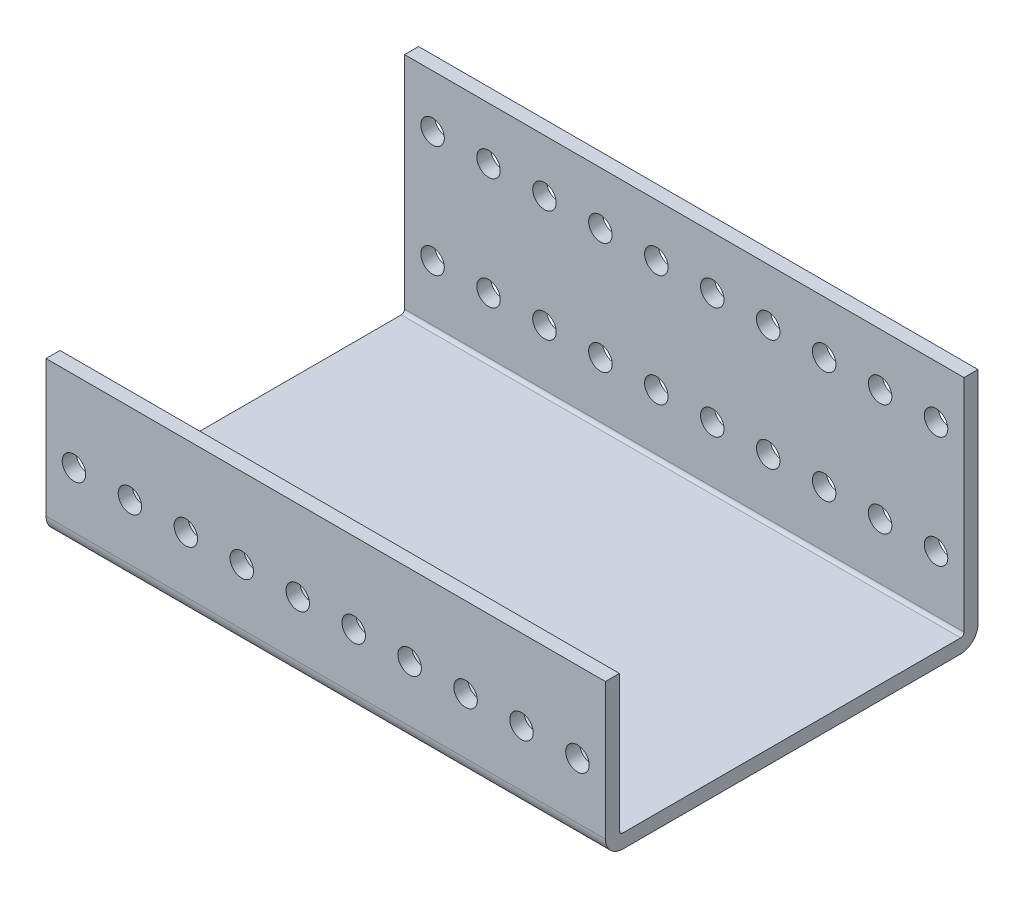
ISO-10303-21;
HEADER;
FILE_DESCRIPTION(('STEP AP214'),'2;1');
FILE_NAME('part.step','',(''),(''),'','','');
FILE_SCHEMA(('AUTOMOTIVE_DESIGN { 1 0 10303 214 1 1 1 1 }'));
ENDSEC;
DATA;
#1=APPLICATION_CONTEXT('core data for automotive mechanical design processes');
#2=APPLICATION_PROTOCOL_DEFINITION('international standard','automotive_design',2000,#1);
#3=PRODUCT_CONTEXT('',#1,'mechanical');
#4=PRODUCT('Part','Part','',(#3));
#5=PRODUCT_RELATED_PRODUCT_CATEGORY('part','',(#4));
#6=PRODUCT_DEFINITION_FORMATION('','',#4);
#7=PRODUCT_DEFINITION_CONTEXT('part definition',#1,'design');
#8=PRODUCT_DEFINITION('design','',#6,#7);
#9=PRODUCT_DEFINITION_SHAPE('','',#8);
#10=(LENGTH_UNIT() NAMED_UNIT(*) SI_UNIT(.MILLI.,.METRE.));
#11=(NAMED_UNIT(*) PLANE_ANGLE_UNIT() SI_UNIT($,.RADIAN.));
#12=(NAMED_UNIT(*) SI_UNIT($,.STERADIAN.) SOLID_ANGLE_UNIT());
#13=UNCERTAINTY_MEASURE_WITH_UNIT(LENGTH_MEASURE(1.E-05),#10,'distance_accuracy_value','');
#14=(GEOMETRIC_REPRESENTATION_CONTEXT(3) GLOBAL_UNCERTAINTY_ASSIGNED_CONTEXT((#13)) GLOBAL_UNIT_ASSIGNED_CONTEXT((#10,
#11,#12)) REPRESENTATION_CONTEXT('',''));
#15=CARTESIAN_POINT('',(0.,0.,0.));
#16=DIRECTION('',(0.,0.,1.));
#17=DIRECTION('',(1.,0.,0.));
#18=AXIS2_PLACEMENT_3D('',#15,#16,#17);
#19=CARTESIAN_POINT('',(361.95,42.037,-76.327));
#20=DIRECTION('',(0.,0.,-1.));
#21=DIRECTION('',(0.,1.,0.));
#22=AXIS2_PLACEMENT_3D('',#19,#20,#21);
#23=CYLINDRICAL_SURFACE('',#22,2.667);
#24=CARTESIAN_POINT('',(361.95,42.037,-78.232));
#25=DIRECTION('',(0.,0.,1.));
#26=DIRECTION('',(0.,-1.,0.));
#27=AXIS2_PLACEMENT_3D('',#24,#25,#26);
#28=CIRCLE('',#27,2.667);
#29=CARTESIAN_POINT('',(361.95,39.37,-78.232));
#30=VERTEX_POINT('',#29);
#31=EDGE_CURVE('E521',#30,#30,#28,.T.);
#32=ORIENTED_EDGE('',*,*,#31,.T.);
#33=EDGE_LOOP('',(#32));
#34=FACE_BOUND('',#33,.T.);
#35=CARTESIAN_POINT('',(361.95,42.037,-81.407));
#36=DIRECTION('',(0.,0.,-1.));
#37=DIRECTION('',(0.,1.,0.));
#38=AXIS2_PLACEMENT_3D('',#35,#36,#37);
#39=CIRCLE('',#38,2.667);
#40=CARTESIAN_POINT('',(361.95,44.704,-81.407));
#41=VERTEX_POINT('',#40);
#42=EDGE_CURVE('E421',#41,#41,#39,.T.);
#43=ORIENTED_EDGE('',*,*,#42,.T.);
#44=EDGE_LOOP('',(#43));
#45=FACE_BOUND('',#44,.T.);
#46=ADVANCED_FACE('F17',(#34,#45),#23,.F.);
#47=CARTESIAN_POINT('',(374.65,42.037,-76.327));
#48=DIRECTION('',(0.,0.,-1.));
#49=DIRECTION('',(0.,1.,0.));
#50=AXIS2_PLACEMENT_3D('',#47,#48,#49);
#51=CYLINDRICAL_SURFACE('',#50,2.667);
#52=CARTESIAN_POINT('',(374.65,42.037,-78.232));
#53=DIRECTION('',(0.,0.,1.));
#54=DIRECTION('',(0.,-1.,0.));
#55=AXIS2_PLACEMENT_3D('',#52,#53,#54);
#56=CIRCLE('',#55,2.667);
#57=CARTESIAN_POINT('',(374.65,39.37,-78.232));
#58=VERTEX_POINT('',#57);
#59=EDGE_CURVE('E524',#58,#58,#56,.T.);
#60=ORIENTED_EDGE('',*,*,#59,.T.);
#61=EDGE_LOOP('',(#60));
#62=FACE_BOUND('',#61,.T.);
#63=CARTESIAN_POINT('',(374.65,42.037,-81.407));
#64=DIRECTION('',(0.,0.,-1.));
#65=DIRECTION('',(0.,1.,0.));
#66=AXIS2_PLACEMENT_3D('',#63,#64,#65);
#67=CIRCLE('',#66,2.667);
#68=CARTESIAN_POINT('',(374.65,44.704,-81.407));
#69=VERTEX_POINT('',#68);
#70=EDGE_CURVE('E418',#69,#69,#67,.T.);
#71=ORIENTED_EDGE('',*,*,#70,.T.);
#72=EDGE_LOOP('',(#71));
#73=FACE_BOUND('',#72,.T.);
#74=ADVANCED_FACE('F740',(#62,#73),#51,.F.);
#75=CARTESIAN_POINT('',(387.35,42.037,-76.327));
#76=DIRECTION('',(0.,0.,-1.));
#77=DIRECTION('',(0.,1.,0.));
#78=AXIS2_PLACEMENT_3D('',#75,#76,#77);
#79=CYLINDRICAL_SURFACE('',#78,2.667);
#80=CARTESIAN_POINT('',(387.35,42.037,-78.232));
#81=DIRECTION('',(0.,0.,1.));
#82=DIRECTION('',(0.,-1.,0.));
#83=AXIS2_PLACEMENT_3D('',#80,#81,#82);
#84=CIRCLE('',#83,2.667);
#85=CARTESIAN_POINT('',(387.35,39.37,-78.232));
#86=VERTEX_POINT('',#85);
#87=EDGE_CURVE('E537',#86,#86,#84,.T.);
#88=ORIENTED_EDGE('',*,*,#87,.T.);
#89=EDGE_LOOP('',(#88));
#90=FACE_BOUND('',#89,.T.);
#91=CARTESIAN_POINT('',(387.35,42.037,-81.407));
#92=DIRECTION('',(0.,0.,-1.));
#93=DIRECTION('',(0.,1.,0.));
#94=AXIS2_PLACEMENT_3D('',#91,#92,#93);
#95=CIRCLE('',#94,2.667);
#96=CARTESIAN_POINT('',(387.35,44.704,-81.407));
#97=VERTEX_POINT('',#96);
#98=EDGE_CURVE('E417',#97,#97,#95,.T.);
#99=ORIENTED_EDGE('',*,*,#98,.T.);
#100=EDGE_LOOP('',(#99));
#101=FACE_BOUND('',#100,.T.);
#102=ADVANCED_FACE('F746',(#90,#101),#79,.F.);
#103=CARTESIAN_POINT('',(400.05,42.037,-76.327));
#104=DIRECTION('',(0.,0.,-1.));
#105=DIRECTION('',(0.,1.,0.));
#106=AXIS2_PLACEMENT_3D('',#103,#104,#105);
#107=CYLINDRICAL_SURFACE('',#106,2.667);
#108=CARTESIAN_POINT('',(400.05,42.037,-78.232));
#109=DIRECTION('',(0.,0.,1.));
#110=DIRECTION('',(0.,-1.,0.));
#111=AXIS2_PLACEMENT_3D('',#108,#109,#110);
#112=CIRCLE('',#111,2.667);
#113=CARTESIAN_POINT('',(400.05,39.37,-78.232));
#114=VERTEX_POINT('',#113);
#115=EDGE_CURVE('E531',#114,#114,#112,.T.);
#116=ORIENTED_EDGE('',*,*,#115,.T.);
#117=EDGE_LOOP('',(#116));
#118=FACE_BOUND('',#117,.T.);
#119=CARTESIAN_POINT('',(400.05,42.037,-81.407));
#120=DIRECTION('',(0.,0.,-1.));
#121=DIRECTION('',(0.,1.,0.));
#122=AXIS2_PLACEMENT_3D('',#119,#120,#121);
#123=CIRCLE('',#122,2.667);
#124=CARTESIAN_POINT('',(400.05,44.704,-81.407));
#125=VERTEX_POINT('',#124);
#126=EDGE_CURVE('E414',#125,#125,#123,.T.);
#127=ORIENTED_EDGE('',*,*,#126,.T.);
#128=EDGE_LOOP('',(#127));
#129=FACE_BOUND('',#128,.T.);
#130=ADVANCED_FACE('F883',(#118,#129),#107,.F.);
#131=CARTESIAN_POINT('',(412.75,42.037,-76.327));
#132=DIRECTION('',(0.,0.,-1.));
#133=DIRECTION('',(0.,1.,0.));
#134=AXIS2_PLACEMENT_3D('',#131,#132,#133);
#135=CYLINDRICAL_SURFACE('',#134,2.667);
#136=CARTESIAN_POINT('',(412.75,42.037,-78.232));
#137=DIRECTION('',(0.,0.,1.));
#138=DIRECTION('',(0.,-1.,0.));
#139=AXIS2_PLACEMENT_3D('',#136,#137,#138);
#140=CIRCLE('',#139,2.667);
#141=CARTESIAN_POINT('',(412.75,39.37,-78.232));
#142=VERTEX_POINT('',#141);
#143=EDGE_CURVE('E528',#142,#142,#140,.T.);
#144=ORIENTED_EDGE('',*,*,#143,.T.);
#145=EDGE_LOOP('',(#144));
#146=FACE_BOUND('',#145,.T.);
#147=CARTESIAN_POINT('',(412.75,42.037,-81.407));
#148=DIRECTION('',(0.,0.,-1.));
#149=DIRECTION('',(0.,1.,0.));
#150=AXIS2_PLACEMENT_3D('',#147,#148,#149);
#151=CIRCLE('',#150,2.667);
#152=CARTESIAN_POINT('',(412.75,44.704,-81.407));
#153=VERTEX_POINT('',#152);
#154=EDGE_CURVE('E407',#153,#153,#151,.T.);
#155=ORIENTED_EDGE('',*,*,#154,.T.);
#156=EDGE_LOOP('',(#155));
#157=FACE_BOUND('',#156,.T.);
#158=ADVANCED_FACE('F899',(#146,#157),#135,.F.);
#159=CARTESIAN_POINT('',(425.45,42.037,-76.327));
#160=DIRECTION('',(0.,0.,-1.));
#161=DIRECTION('',(0.,1.,0.));
#162=AXIS2_PLACEMENT_3D('',#159,#160,#161);
#163=CYLINDRICAL_SURFACE('',#162,2.667);
#164=CARTESIAN_POINT('',(425.45,42.037,-78.232));
#165=DIRECTION('',(0.,0.,1.));
#166=DIRECTION('',(0.,-1.,0.));
#167=AXIS2_PLACEMENT_3D('',#164,#165,#166);
#168=CIRCLE('',#167,2.667);
#169=CARTESIAN_POINT('',(425.45,39.37,-78.232));
#170=VERTEX_POINT('',#169);
#171=EDGE_CURVE('E527',#170,#170,#168,.T.);
#172=ORIENTED_EDGE('',*,*,#171,.T.);
#173=EDGE_LOOP('',(#172));
#174=FACE_BOUND('',#173,.T.);
#175=CARTESIAN_POINT('',(425.45,42.037,-81.407));
#176=DIRECTION('',(0.,0.,-1.));
#177=DIRECTION('',(0.,1.,0.));
#178=AXIS2_PLACEMENT_3D('',#175,#176,#177);
#179=CIRCLE('',#178,2.667);
#180=CARTESIAN_POINT('',(425.45,44.704,-81.407));
#181=VERTEX_POINT('',#180);
#182=EDGE_CURVE('E403',#181,#181,#179,.T.);
#183=ORIENTED_EDGE('',*,*,#182,.T.);
#184=EDGE_LOOP('',(#183));
#185=FACE_BOUND('',#184,.T.);
#186=ADVANCED_FACE('F895',(#174,#185),#163,.F.);
#187=CARTESIAN_POINT('',(438.15,42.037,-76.327));
#188=DIRECTION('',(0.,0.,-1.));
#189=DIRECTION('',(0.,1.,0.));
#190=AXIS2_PLACEMENT_3D('',#187,#188,#189);
#191=CYLINDRICAL_SURFACE('',#190,2.667);
#192=CARTESIAN_POINT('',(438.15,42.037,-78.232));
#193=DIRECTION('',(0.,0.,1.));
#194=DIRECTION('',(0.,-1.,0.));
#195=AXIS2_PLACEMENT_3D('',#192,#193,#194);
#196=CIRCLE('',#195,2.667);
#197=CARTESIAN_POINT('',(438.15,39.37,-78.232));
#198=VERTEX_POINT('',#197);
#199=EDGE_CURVE('E517',#198,#198,#196,.T.);
#200=ORIENTED_EDGE('',*,*,#199,.T.);
#201=EDGE_LOOP('',(#200));
#202=FACE_BOUND('',#201,.T.);
#203=CARTESIAN_POINT('',(438.15,42.037,-81.407));
#204=DIRECTION('',(0.,0.,-1.));
#205=DIRECTION('',(0.,1.,0.));
#206=AXIS2_PLACEMENT_3D('',#203,#204,#205);
#207=CIRCLE('',#206,2.667);
#208=CARTESIAN_POINT('',(438.15,44.704,-81.407));
#209=VERTEX_POINT('',#208);
#210=EDGE_CURVE('E400',#209,#209,#207,.T.);
#211=ORIENTED_EDGE('',*,*,#210,.T.);
#212=EDGE_LOOP('',(#211));
#213=FACE_BOUND('',#212,.T.);
#214=ADVANCED_FACE('F891',(#202,#213),#191,.F.);
#215=CARTESIAN_POINT('',(450.85,42.037,-76.327));
#216=DIRECTION('',(0.,0.,-1.));
#217=DIRECTION('',(0.,1.,0.));
#218=AXIS2_PLACEMENT_3D('',#215,#216,#217);
#219=CYLINDRICAL_SURFACE('',#218,2.667);
#220=CARTESIAN_POINT('',(450.85,42.037,-78.232));
#221=DIRECTION('',(0.,0.,1.));
#222=DIRECTION('',(0.,-1.,0.));
#223=AXIS2_PLACEMENT_3D('',#220,#221,#222);
#224=CIRCLE('',#223,2.667);
#225=CARTESIAN_POINT('',(450.85,39.37,-78.232));
#226=VERTEX_POINT('',#225);
#227=EDGE_CURVE('E514',#226,#226,#224,.T.);
#228=ORIENTED_EDGE('',*,*,#227,.T.);
#229=EDGE_LOOP('',(#228));
#230=FACE_BOUND('',#229,.T.);
#231=CARTESIAN_POINT('',(450.85,42.037,-81.407));
#232=DIRECTION('',(0.,0.,-1.));
#233=DIRECTION('',(0.,1.,0.));
#234=AXIS2_PLACEMENT_3D('',#231,#232,#233);
#235=CIRCLE('',#234,2.667);
#236=CARTESIAN_POINT('',(450.85,44.704,-81.407));
#237=VERTEX_POINT('',#236);
#238=EDGE_CURVE('E404',#237,#237,#235,.T.);
#239=ORIENTED_EDGE('',*,*,#238,.T.);
#240=EDGE_LOOP('',(#239));
#241=FACE_BOUND('',#240,.T.);
#242=ADVANCED_FACE('F887',(#230,#241),#219,.F.);
#243=CARTESIAN_POINT('',(463.55,42.037,-76.327));
#244=DIRECTION('',(0.,0.,-1.));
#245=DIRECTION('',(0.,1.,0.));
#246=AXIS2_PLACEMENT_3D('',#243,#244,#245);
#247=CYLINDRICAL_SURFACE('',#246,2.667);
#248=CARTESIAN_POINT('',(463.55,42.037,-78.232));
#249=DIRECTION('',(0.,0.,1.));
#250=DIRECTION('',(0.,-1.,0.));
#251=AXIS2_PLACEMENT_3D('',#248,#249,#250);
#252=CIRCLE('',#251,2.667);
#253=CARTESIAN_POINT('',(463.55,39.37,-78.232));
#254=VERTEX_POINT('',#253);
#255=EDGE_CURVE('E518',#254,#254,#252,.T.);
#256=ORIENTED_EDGE('',*,*,#255,.T.);
#257=EDGE_LOOP('',(#256));
#258=FACE_BOUND('',#257,.T.);
#259=CARTESIAN_POINT('',(463.55,42.037,-81.407));
#260=DIRECTION('',(0.,0.,-1.));
#261=DIRECTION('',(0.,1.,0.));
#262=AXIS2_PLACEMENT_3D('',#259,#260,#261);
#263=CIRCLE('',#262,2.667);
#264=CARTESIAN_POINT('',(463.55,44.704,-81.407));
#265=VERTEX_POINT('',#264);
#266=EDGE_CURVE('E398',#265,#265,#263,.T.);
#267=ORIENTED_EDGE('',*,*,#266,.T.);
#268=EDGE_LOOP('',(#267));
#269=FACE_BOUND('',#268,.T.);
#270=ADVANCED_FACE('F837',(#258,#269),#247,.F.);
#271=CARTESIAN_POINT('',(476.25,42.037,-76.327));
#272=DIRECTION('',(0.,0.,-1.));
#273=DIRECTION('',(0.,1.,0.));
#274=AXIS2_PLACEMENT_3D('',#271,#272,#273);
#275=CYLINDRICAL_SURFACE('',#274,2.667);
#276=CARTESIAN_POINT('',(476.25,42.037,-78.232));
#277=DIRECTION('',(0.,0.,1.));
#278=DIRECTION('',(0.,-1.,0.));
#279=AXIS2_PLACEMENT_3D('',#276,#277,#278);
#280=CIRCLE('',#279,2.667);
#281=CARTESIAN_POINT('',(476.25,39.37,-78.232));
#282=VERTEX_POINT('',#281);
#283=EDGE_CURVE('E513',#282,#282,#280,.T.);
#284=ORIENTED_EDGE('',*,*,#283,.T.);
#285=EDGE_LOOP('',(#284));
#286=FACE_BOUND('',#285,.T.);
#287=CARTESIAN_POINT('',(476.25,42.037,-81.407));
#288=DIRECTION('',(0.,0.,-1.));
#289=DIRECTION('',(0.,1.,0.));
#290=AXIS2_PLACEMENT_3D('',#287,#288,#289);
#291=CIRCLE('',#290,2.667);
#292=CARTESIAN_POINT('',(476.25,44.704,-81.407));
#293=VERTEX_POINT('',#292);
#294=EDGE_CURVE('E395',#293,#293,#291,.T.);
#295=ORIENTED_EDGE('',*,*,#294,.T.);
#296=EDGE_LOOP('',(#295));
#297=FACE_BOUND('',#296,.T.);
#298=ADVANCED_FACE('F833',(#286,#297),#275,.F.);
#299=CARTESIAN_POINT('',(361.95,16.637,-81.407));
#300=DIRECTION('',(0.,0.,1.));
#301=DIRECTION('',(1.,0.,0.));
#302=AXIS2_PLACEMENT_3D('',#299,#300,#301);
#303=CYLINDRICAL_SURFACE('',#302,2.667);
#304=CARTESIAN_POINT('',(361.95,16.637,0.));
#305=DIRECTION('',(0.,0.,-1.));
#306=DIRECTION('',(-1.,0.,0.));
#307=AXIS2_PLACEMENT_3D('',#304,#305,#306);
#308=CIRCLE('',#307,2.667);
#309=CARTESIAN_POINT('',(359.283,16.637,0.));
#310=VERTEX_POINT('',#309);
#311=EDGE_CURVE('E632',#310,#310,#308,.T.);
#312=ORIENTED_EDGE('',*,*,#311,.T.);
#313=EDGE_LOOP('',(#312));
#314=FACE_BOUND('',#313,.T.);
#315=CARTESIAN_POINT('',(361.95,16.637,3.175));
#316=DIRECTION('',(0.,0.,1.));
#317=DIRECTION('',(1.,0.,0.));
#318=AXIS2_PLACEMENT_3D('',#315,#316,#317);
#319=CIRCLE('',#318,2.667);
#320=CARTESIAN_POINT('',(364.617,16.637,3.175));
#321=VERTEX_POINT('',#320);
#322=EDGE_CURVE('E684',#321,#321,#319,.T.);
#323=ORIENTED_EDGE('',*,*,#322,.T.);
#324=EDGE_LOOP('',(#323));
#325=FACE_BOUND('',#324,.T.);
#326=ADVANCED_FACE('F836',(#314,#325),#303,.F.);
#327=CARTESIAN_POINT('',(374.65,16.637,-81.407));
#328=DIRECTION('',(0.,0.,1.));
#329=DIRECTION('',(1.,0.,0.));
#330=AXIS2_PLACEMENT_3D('',#327,#328,#329);
#331=CYLINDRICAL_SURFACE('',#330,2.667);
#332=CARTESIAN_POINT('',(374.65,16.637,0.));
#333=DIRECTION('',(0.,0.,-1.));
#334=DIRECTION('',(-1.,0.,0.));
#335=AXIS2_PLACEMENT_3D('',#332,#333,#334);
#336=CIRCLE('',#335,2.667);
#337=CARTESIAN_POINT('',(371.983,16.637,0.));
#338=VERTEX_POINT('',#337);
#339=EDGE_CURVE('E604',#338,#338,#336,.T.);
#340=ORIENTED_EDGE('',*,*,#339,.T.);
#341=EDGE_LOOP('',(#340));
#342=FACE_BOUND('',#341,.T.);
#343=CARTESIAN_POINT('',(374.65,16.637,3.175));
#344=DIRECTION('',(0.,0.,1.));
#345=DIRECTION('',(1.,0.,0.));
#346=AXIS2_PLACEMENT_3D('',#343,#344,#345);
#347=CIRCLE('',#346,2.667);
#348=CARTESIAN_POINT('',(377.317,16.637,3.175));
#349=VERTEX_POINT('',#348);
#350=EDGE_CURVE('E675',#349,#349,#347,.T.);
#351=ORIENTED_EDGE('',*,*,#350,.T.);
#352=EDGE_LOOP('',(#351));
#353=FACE_BOUND('',#352,.T.);
#354=ADVANCED_FACE('F869',(#342,#353),#331,.F.);
#355=CARTESIAN_POINT('',(387.35,16.637,-81.407));
#356=DIRECTION('',(0.,0.,1.));
#357=DIRECTION('',(1.,0.,0.));
#358=AXIS2_PLACEMENT_3D('',#355,#356,#357);
#359=CYLINDRICAL_SURFACE('',#358,2.667);
#360=CARTESIAN_POINT('',(387.35,16.637,0.));
#361=DIRECTION('',(0.,0.,-1.));
#362=DIRECTION('',(-1.,0.,0.));
#363=AXIS2_PLACEMENT_3D('',#360,#361,#362);
#364=CIRCLE('',#363,2.667);
#365=CARTESIAN_POINT('',(384.683,16.637,0.));
#366=VERTEX_POINT('',#365);
#367=EDGE_CURVE('E601',#366,#366,#364,.T.);
#368=ORIENTED_EDGE('',*,*,#367,.T.);
#369=EDGE_LOOP('',(#368));
#370=FACE_BOUND('',#369,.T.);
#371=CARTESIAN_POINT('',(387.35,16.637,3.175));
#372=DIRECTION('',(0.,0.,1.));
#373=DIRECTION('',(1.,0.,0.));
#374=AXIS2_PLACEMENT_3D('',#371,#372,#373);
#375=CIRCLE('',#374,2.667);
#376=CARTESIAN_POINT('',(390.017,16.637,3.175));
#377=VERTEX_POINT('',#376);
#378=EDGE_CURVE('E672',#377,#377,#375,.T.);
#379=ORIENTED_EDGE('',*,*,#378,.T.);
#380=EDGE_LOOP('',(#379));
#381=FACE_BOUND('',#380,.T.);
#382=ADVANCED_FACE('F873',(#370,#381),#359,.F.);
#383=CARTESIAN_POINT('',(400.05,16.637,-81.407));
#384=DIRECTION('',(0.,0.,1.));
#385=DIRECTION('',(1.,0.,0.));
#386=AXIS2_PLACEMENT_3D('',#383,#384,#385);
#387=CYLINDRICAL_SURFACE('',#386,2.667);
#388=CARTESIAN_POINT('',(400.05,16.637,0.));
#389=DIRECTION('',(0.,0.,-1.));
#390=DIRECTION('',(-1.,0.,0.));
#391=AXIS2_PLACEMENT_3D('',#388,#389,#390);
#392=CIRCLE('',#391,2.667);
#393=CARTESIAN_POINT('',(397.383,16.637,0.));
#394=VERTEX_POINT('',#393);
#395=EDGE_CURVE('E605',#394,#394,#392,.T.);
#396=ORIENTED_EDGE('',*,*,#395,.T.);
#397=EDGE_LOOP('',(#396));
#398=FACE_BOUND('',#397,.T.);
#399=CARTESIAN_POINT('',(400.05,16.637,3.175));
#400=DIRECTION('',(0.,0.,1.));
#401=DIRECTION('',(1.,0.,0.));
#402=AXIS2_PLACEMENT_3D('',#399,#400,#401);
#403=CIRCLE('',#402,2.667);
#404=CARTESIAN_POINT('',(402.717,16.637,3.175));
#405=VERTEX_POINT('',#404);
#406=EDGE_CURVE('E599',#405,#405,#403,.T.);
#407=ORIENTED_EDGE('',*,*,#406,.T.);
#408=EDGE_LOOP('',(#407));
#409=FACE_BOUND('',#408,.T.);
#410=ADVANCED_FACE('F865',(#398,#409),#387,.F.);
#411=CARTESIAN_POINT('',(412.75,16.637,-81.407));
#412=DIRECTION('',(0.,0.,1.));
#413=DIRECTION('',(1.,0.,0.));
#414=AXIS2_PLACEMENT_3D('',#411,#412,#413);
#415=CYLINDRICAL_SURFACE('',#414,2.667);
#416=CARTESIAN_POINT('',(412.75,16.637,0.));
#417=DIRECTION('',(0.,0.,-1.));
#418=DIRECTION('',(-1.,0.,0.));
#419=AXIS2_PLACEMENT_3D('',#416,#417,#418);
#420=CIRCLE('',#419,2.667);
#421=CARTESIAN_POINT('',(410.083,16.637,0.));
#422=VERTEX_POINT('',#421);
#423=EDGE_CURVE('E581',#422,#422,#420,.T.);
#424=ORIENTED_EDGE('',*,*,#423,.T.);
#425=EDGE_LOOP('',(#424));
#426=FACE_BOUND('',#425,.T.);
#427=CARTESIAN_POINT('',(412.75,16.637,3.175));
#428=DIRECTION('',(0.,0.,1.));
#429=DIRECTION('',(1.,0.,0.));
#430=AXIS2_PLACEMENT_3D('',#427,#428,#429);
#431=CIRCLE('',#430,2.667);
#432=CARTESIAN_POINT('',(415.417,16.637,3.175));
#433=VERTEX_POINT('',#432);
#434=EDGE_CURVE('E596',#433,#433,#431,.T.);
#435=ORIENTED_EDGE('',*,*,#434,.T.);
#436=EDGE_LOOP('',(#435));
#437=FACE_BOUND('',#436,.T.);
#438=ADVANCED_FACE('F861',(#426,#437),#415,.F.);
#439=CARTESIAN_POINT('',(425.45,16.637,-81.407));
#440=DIRECTION('',(0.,0.,1.));
#441=DIRECTION('',(1.,0.,0.));
#442=AXIS2_PLACEMENT_3D('',#439,#440,#441);
#443=CYLINDRICAL_SURFACE('',#442,2.667);
#444=CARTESIAN_POINT('',(425.45,16.637,0.));
#445=DIRECTION('',(0.,0.,-1.));
#446=DIRECTION('',(-1.,0.,0.));
#447=AXIS2_PLACEMENT_3D('',#444,#445,#446);
#448=CIRCLE('',#447,2.667);
#449=CARTESIAN_POINT('',(422.783,16.637,0.));
#450=VERTEX_POINT('',#449);
#451=EDGE_CURVE('E579',#450,#450,#448,.T.);
#452=ORIENTED_EDGE('',*,*,#451,.T.);
#453=EDGE_LOOP('',(#452));
#454=FACE_BOUND('',#453,.T.);
#455=CARTESIAN_POINT('',(425.45,16.637,3.175));
#456=DIRECTION('',(0.,0.,1.));
#457=DIRECTION('',(1.,0.,0.));
#458=AXIS2_PLACEMENT_3D('',#455,#456,#457);
#459=CIRCLE('',#458,2.667);
#460=CARTESIAN_POINT('',(428.117,16.637,3.175));
#461=VERTEX_POINT('',#460);
#462=EDGE_CURVE('E600',#461,#461,#459,.T.);
#463=ORIENTED_EDGE('',*,*,#462,.T.);
#464=EDGE_LOOP('',(#463));
#465=FACE_BOUND('',#464,.T.);
#466=ADVANCED_FACE('F857',(#454,#465),#443,.F.);
#467=CARTESIAN_POINT('',(438.15,16.637,-81.407));
#468=DIRECTION('',(0.,0.,1.));
#469=DIRECTION('',(1.,0.,0.));
#470=AXIS2_PLACEMENT_3D('',#467,#468,#469);
#471=CYLINDRICAL_SURFACE('',#470,2.667);
#472=CARTESIAN_POINT('',(438.15,16.637,0.));
#473=DIRECTION('',(0.,0.,-1.));
#474=DIRECTION('',(-1.,0.,0.));
#475=AXIS2_PLACEMENT_3D('',#472,#473,#474);
#476=CIRCLE('',#475,2.667);
#477=CARTESIAN_POINT('',(435.483,16.637,0.));
#478=VERTEX_POINT('',#477);
#479=EDGE_CURVE('E582',#478,#478,#476,.T.);
#480=ORIENTED_EDGE('',*,*,#479,.T.);
#481=EDGE_LOOP('',(#480));
#482=FACE_BOUND('',#481,.T.);
#483=CARTESIAN_POINT('',(438.15,16.637,3.175));
#484=DIRECTION('',(0.,0.,1.));
#485=DIRECTION('',(1.,0.,0.));
#486=AXIS2_PLACEMENT_3D('',#483,#484,#485);
#487=CIRCLE('',#486,2.667);
#488=CARTESIAN_POINT('',(440.817,16.637,3.175));
#489=VERTEX_POINT('',#488);
#490=EDGE_CURVE('E618',#489,#489,#487,.T.);
#491=ORIENTED_EDGE('',*,*,#490,.T.);
#492=EDGE_LOOP('',(#491));
#493=FACE_BOUND('',#492,.T.);
#494=ADVANCED_FACE('F853',(#482,#493),#471,.F.);
#495=CARTESIAN_POINT('',(450.85,16.637,-81.407));
#496=DIRECTION('',(0.,0.,1.));
#497=DIRECTION('',(1.,0.,0.));
#498=AXIS2_PLACEMENT_3D('',#495,#496,#497);
#499=CYLINDRICAL_SURFACE('',#498,2.667);
#500=CARTESIAN_POINT('',(450.85,16.637,0.));
#501=DIRECTION('',(0.,0.,-1.));
#502=DIRECTION('',(-1.,0.,0.));
#503=AXIS2_PLACEMENT_3D('',#500,#501,#502);
#504=CIRCLE('',#503,2.667);
#505=CARTESIAN_POINT('',(448.183,16.637,0.));
#506=VERTEX_POINT('',#505);
#507=EDGE_CURVE('E583',#506,#506,#504,.T.);
#508=ORIENTED_EDGE('',*,*,#507,.T.);
#509=EDGE_LOOP('',(#508));
#510=FACE_BOUND('',#509,.T.);
#511=CARTESIAN_POINT('',(450.85,16.637,3.175));
#512=DIRECTION('',(0.,0.,1.));
#513=DIRECTION('',(1.,0.,0.));
#514=AXIS2_PLACEMENT_3D('',#511,#512,#513);
#515=CIRCLE('',#514,2.667);
#516=CARTESIAN_POINT('',(453.517,16.637,3.175));
#517=VERTEX_POINT('',#516);
#518=EDGE_CURVE('E621',#517,#517,#515,.T.);
#519=ORIENTED_EDGE('',*,*,#518,.T.);
#520=EDGE_LOOP('',(#519));
#521=FACE_BOUND('',#520,.T.);
#522=ADVANCED_FACE('F849',(#510,#521),#499,.F.);
#523=CARTESIAN_POINT('',(463.55,16.637,-81.407));
#524=DIRECTION('',(0.,0.,1.));
#525=DIRECTION('',(1.,0.,0.));
#526=AXIS2_PLACEMENT_3D('',#523,#524,#525);
#527=CYLINDRICAL_SURFACE('',#526,2.667);
#528=CARTESIAN_POINT('',(463.55,16.637,0.));
#529=DIRECTION('',(0.,0.,-1.));
#530=DIRECTION('',(-1.,0.,0.));
#531=AXIS2_PLACEMENT_3D('',#528,#529,#530);
#532=CIRCLE('',#531,2.667);
#533=CARTESIAN_POINT('',(460.883,16.637,0.));
#534=VERTEX_POINT('',#533);
#535=EDGE_CURVE('E586',#534,#534,#532,.T.);
#536=ORIENTED_EDGE('',*,*,#535,.T.);
#537=EDGE_LOOP('',(#536));
#538=FACE_BOUND('',#537,.T.);
#539=CARTESIAN_POINT('',(463.55,16.637,3.175));
#540=DIRECTION('',(0.,0.,1.));
#541=DIRECTION('',(1.,0.,0.));
#542=AXIS2_PLACEMENT_3D('',#539,#540,#541);
#543=CIRCLE('',#542,2.667);
#544=CARTESIAN_POINT('',(466.217,16.637,3.175));
#545=VERTEX_POINT('',#544);
#546=EDGE_CURVE('E662',#545,#545,#543,.T.);
#547=ORIENTED_EDGE('',*,*,#546,.T.);
#548=EDGE_LOOP('',(#547));
#549=FACE_BOUND('',#548,.T.);
#550=ADVANCED_FACE('F845',(#538,#549),#527,.F.);
#551=CARTESIAN_POINT('',(476.25,16.637,-81.407));
#552=DIRECTION('',(0.,0.,1.));
#553=DIRECTION('',(1.,0.,0.));
#554=AXIS2_PLACEMENT_3D('',#551,#552,#553);
#555=CYLINDRICAL_SURFACE('',#554,2.667);
#556=CARTESIAN_POINT('',(476.25,16.637,0.));
#557=DIRECTION('',(0.,0.,-1.));
#558=DIRECTION('',(-1.,0.,0.));
#559=AXIS2_PLACEMENT_3D('',#556,#557,#558);
#560=CIRCLE('',#559,2.667);
#561=CARTESIAN_POINT('',(473.583,16.637,0.));
#562=VERTEX_POINT('',#561);
#563=EDGE_CURVE('E609',#562,#562,#560,.T.);
#564=ORIENTED_EDGE('',*,*,#563,.T.);
#565=EDGE_LOOP('',(#564));
#566=FACE_BOUND('',#565,.T.);
#567=CARTESIAN_POINT('',(476.25,16.637,3.175));
#568=DIRECTION('',(0.,0.,1.));
#569=DIRECTION('',(1.,0.,0.));
#570=AXIS2_PLACEMENT_3D('',#567,#568,#569);
#571=CIRCLE('',#570,2.667);
#572=CARTESIAN_POINT('',(478.917,16.637,3.175));
#573=VERTEX_POINT('',#572);
#574=EDGE_CURVE('E654',#573,#573,#571,.T.);
#575=ORIENTED_EDGE('',*,*,#574,.T.);
#576=EDGE_LOOP('',(#575));
#577=FACE_BOUND('',#576,.T.);
#578=ADVANCED_FACE('F841',(#566,#577),#555,.F.);
#579=CARTESIAN_POINT('',(361.95,16.637,-81.407));
#580=DIRECTION('',(0.,0.,1.));
#581=DIRECTION('',(1.,0.,0.));
#582=AXIS2_PLACEMENT_3D('',#579,#580,#581);
#583=CYLINDRICAL_SURFACE('',#582,2.667);
#584=CARTESIAN_POINT('',(361.95,16.637,-81.407));
#585=DIRECTION('',(0.,0.,1.));
#586=DIRECTION('',(1.,0.,0.));
#587=AXIS2_PLACEMENT_3D('',#584,#585,#586);
#588=CIRCLE('',#587,2.667);
#589=CARTESIAN_POINT('',(364.617,16.637,-81.407));
#590=VERTEX_POINT('',#589);
#591=EDGE_CURVE('E399',#590,#590,#588,.T.);
#592=ORIENTED_EDGE('',*,*,#591,.F.);
#593=EDGE_LOOP('',(#592));
#594=FACE_BOUND('',#593,.T.);
#595=CARTESIAN_POINT('',(361.95,16.637,-78.232));
#596=DIRECTION('',(0.,0.,1.));
#597=DIRECTION('',(0.,-1.,0.));
#598=AXIS2_PLACEMENT_3D('',#595,#596,#597);
#599=CIRCLE('',#598,2.667);
#600=CARTESIAN_POINT('',(361.95,13.97,-78.232));
#601=VERTEX_POINT('',#600);
#602=EDGE_CURVE('E510',#601,#601,#599,.T.);
#603=ORIENTED_EDGE('',*,*,#602,.T.);
#604=EDGE_LOOP('',(#603));
#605=FACE_BOUND('',#604,.T.);
#606=ADVANCED_FACE('F831',(#594,#605),#583,.F.);
#607=CARTESIAN_POINT('',(374.65,16.637,-81.407));
#608=DIRECTION('',(0.,0.,1.));
#609=DIRECTION('',(1.,0.,0.));
#610=AXIS2_PLACEMENT_3D('',#607,#608,#609);
#611=CYLINDRICAL_SURFACE('',#610,2.667);
#612=CARTESIAN_POINT('',(374.65,16.637,-81.407));
#613=DIRECTION('',(0.,0.,1.));
#614=DIRECTION('',(1.,0.,0.));
#615=AXIS2_PLACEMENT_3D('',#612,#613,#614);
#616=CIRCLE('',#615,2.667);
#617=CARTESIAN_POINT('',(377.317,16.637,-81.407));
#618=VERTEX_POINT('',#617);
#619=EDGE_CURVE('E394',#618,#618,#616,.T.);
#620=ORIENTED_EDGE('',*,*,#619,.F.);
#621=EDGE_LOOP('',(#620));
#622=FACE_BOUND('',#621,.T.);
#623=CARTESIAN_POINT('',(374.65,16.637,-78.232));
#624=DIRECTION('',(0.,0.,1.));
#625=DIRECTION('',(0.,-1.,0.));
#626=AXIS2_PLACEMENT_3D('',#623,#624,#625);
#627=CIRCLE('',#626,2.667);
#628=CARTESIAN_POINT('',(374.65,13.97,-78.232));
#629=VERTEX_POINT('',#628);
#630=EDGE_CURVE('E507',#629,#629,#627,.T.);
#631=ORIENTED_EDGE('',*,*,#630,.T.);
#632=EDGE_LOOP('',(#631));
#633=FACE_BOUND('',#632,.T.);
#634=ADVANCED_FACE('F827',(#622,#633),#611,.F.);
#635=CARTESIAN_POINT('',(387.35,16.637,-81.407));
#636=DIRECTION('',(0.,0.,1.));
#637=DIRECTION('',(1.,0.,0.));
#638=AXIS2_PLACEMENT_3D('',#635,#636,#637);
#639=CYLINDRICAL_SURFACE('',#638,2.667);
#640=CARTESIAN_POINT('',(387.35,16.637,-81.407));
#641=DIRECTION('',(0.,0.,1.));
#642=DIRECTION('',(1.,0.,0.));
#643=AXIS2_PLACEMENT_3D('',#640,#641,#642);
#644=CIRCLE('',#643,2.667);
#645=CARTESIAN_POINT('',(390.017,16.637,-81.407));
#646=VERTEX_POINT('',#645);
#647=EDGE_CURVE('E391',#646,#646,#644,.T.);
#648=ORIENTED_EDGE('',*,*,#647,.F.);
#649=EDGE_LOOP('',(#648));
#650=FACE_BOUND('',#649,.T.);
#651=CARTESIAN_POINT('',(387.35,16.637,-78.232));
#652=DIRECTION('',(0.,0.,1.));
#653=DIRECTION('',(0.,-1.,0.));
#654=AXIS2_PLACEMENT_3D('',#651,#652,#653);
#655=CIRCLE('',#654,2.667);
#656=CARTESIAN_POINT('',(387.35,13.97,-78.232));
#657=VERTEX_POINT('',#656);
#658=EDGE_CURVE('E504',#657,#657,#655,.T.);
#659=ORIENTED_EDGE('',*,*,#658,.T.);
#660=EDGE_LOOP('',(#659));
#661=FACE_BOUND('',#660,.T.);
#662=ADVANCED_FACE('F823',(#650,#661),#639,.F.);
#663=CARTESIAN_POINT('',(400.05,16.637,-81.407));
#664=DIRECTION('',(0.,0.,1.));
#665=DIRECTION('',(1.,0.,0.));
#666=AXIS2_PLACEMENT_3D('',#663,#664,#665);
#667=CYLINDRICAL_SURFACE('',#666,2.667);
#668=CARTESIAN_POINT('',(400.05,16.637,-81.407));
#669=DIRECTION('',(0.,0.,1.));
#670=DIRECTION('',(1.,0.,0.));
#671=AXIS2_PLACEMENT_3D('',#668,#669,#670);
#672=CIRCLE('',#671,2.667);
#673=CARTESIAN_POINT('',(402.717,16.637,-81.407));
#674=VERTEX_POINT('',#673);
#675=EDGE_CURVE('E385',#674,#674,#672,.T.);
#676=ORIENTED_EDGE('',*,*,#675,.F.);
#677=EDGE_LOOP('',(#676));
#678=FACE_BOUND('',#677,.T.);
#679=CARTESIAN_POINT('',(400.05,16.637,-78.232));
#680=DIRECTION('',(0.,0.,1.));
#681=DIRECTION('',(0.,-1.,0.));
#682=AXIS2_PLACEMENT_3D('',#679,#680,#681);
#683=CIRCLE('',#682,2.667);
#684=CARTESIAN_POINT('',(400.05,13.97,-78.232));
#685=VERTEX_POINT('',#684);
#686=EDGE_CURVE('E501',#685,#685,#683,.T.);
#687=ORIENTED_EDGE('',*,*,#686,.T.);
#688=EDGE_LOOP('',(#687));
#689=FACE_BOUND('',#688,.T.);
#690=ADVANCED_FACE('F788',(#678,#689),#667,.F.);
#691=CARTESIAN_POINT('',(412.75,16.637,-81.407));
#692=DIRECTION('',(0.,0.,1.));
#693=DIRECTION('',(1.,0.,0.));
#694=AXIS2_PLACEMENT_3D('',#691,#692,#693);
#695=CYLINDRICAL_SURFACE('',#694,2.667);
#696=CARTESIAN_POINT('',(412.75,16.637,-81.407));
#697=DIRECTION('',(0.,0.,1.));
#698=DIRECTION('',(1.,0.,0.));
#699=AXIS2_PLACEMENT_3D('',#696,#697,#698);
#700=CIRCLE('',#699,2.667);
#701=CARTESIAN_POINT('',(415.417,16.637,-81.407));
#702=VERTEX_POINT('',#701);
#703=EDGE_CURVE('E379',#702,#702,#700,.T.);
#704=ORIENTED_EDGE('',*,*,#703,.F.);
#705=EDGE_LOOP('',(#704));
#706=FACE_BOUND('',#705,.T.);
#707=CARTESIAN_POINT('',(412.75,16.637,-78.232));
#708=DIRECTION('',(0.,0.,1.));
#709=DIRECTION('',(0.,-1.,0.));
#710=AXIS2_PLACEMENT_3D('',#707,#708,#709);
#711=CIRCLE('',#710,2.667);
#712=CARTESIAN_POINT('',(412.75,13.97,-78.232));
#713=VERTEX_POINT('',#712);
#714=EDGE_CURVE('E461',#713,#713,#711,.T.);
#715=ORIENTED_EDGE('',*,*,#714,.T.);
#716=EDGE_LOOP('',(#715));
#717=FACE_BOUND('',#716,.T.);
#718=ADVANCED_FACE('F784',(#706,#717),#695,.F.);
#719=CARTESIAN_POINT('',(425.45,16.637,-81.407));
#720=DIRECTION('',(0.,0.,1.));
#721=DIRECTION('',(1.,0.,0.));
#722=AXIS2_PLACEMENT_3D('',#719,#720,#721);
#723=CYLINDRICAL_SURFACE('',#722,2.667);
#724=CARTESIAN_POINT('',(425.45,16.637,-81.407));
#725=DIRECTION('',(0.,0.,1.));
#726=DIRECTION('',(1.,0.,0.));
#727=AXIS2_PLACEMENT_3D('',#724,#725,#726);
#728=CIRCLE('',#727,2.667);
#729=CARTESIAN_POINT('',(428.117,16.637,-81.407));
#730=VERTEX_POINT('',#729);
#731=EDGE_CURVE('E374',#730,#730,#728,.T.);
#732=ORIENTED_EDGE('',*,*,#731,.F.);
#733=EDGE_LOOP('',(#732));
#734=FACE_BOUND('',#733,.T.);
#735=CARTESIAN_POINT('',(425.45,16.637,-78.232));
#736=DIRECTION('',(0.,0.,1.));
#737=DIRECTION('',(0.,-1.,0.));
#738=AXIS2_PLACEMENT_3D('',#735,#736,#737);
#739=CIRCLE('',#738,2.667);
#740=CARTESIAN_POINT('',(425.45,13.97,-78.232));
#741=VERTEX_POINT('',#740);
#742=EDGE_CURVE('E458',#741,#741,#739,.T.);
#743=ORIENTED_EDGE('',*,*,#742,.T.);
#744=EDGE_LOOP('',(#743));
#745=FACE_BOUND('',#744,.T.);
#746=ADVANCED_FACE('F787',(#734,#745),#723,.F.);
#747=CARTESIAN_POINT('',(438.15,16.637,-81.407));
#748=DIRECTION('',(0.,0.,1.));
#749=DIRECTION('',(1.,0.,0.));
#750=AXIS2_PLACEMENT_3D('',#747,#748,#749);
#751=CYLINDRICAL_SURFACE('',#750,2.667);
#752=CARTESIAN_POINT('',(438.15,16.637,-81.407));
#753=DIRECTION('',(0.,0.,1.));
#754=DIRECTION('',(1.,0.,0.));
#755=AXIS2_PLACEMENT_3D('',#752,#753,#754);
#756=CIRCLE('',#755,2.667);
#757=CARTESIAN_POINT('',(440.817,16.637,-81.407));
#758=VERTEX_POINT('',#757);
#759=EDGE_CURVE('E380',#758,#758,#756,.T.);
#760=ORIENTED_EDGE('',*,*,#759,.F.);
#761=EDGE_LOOP('',(#760));
#762=FACE_BOUND('',#761,.T.);
#763=CARTESIAN_POINT('',(438.15,16.637,-78.232));
#764=DIRECTION('',(0.,0.,1.));
#765=DIRECTION('',(0.,-1.,0.));
#766=AXIS2_PLACEMENT_3D('',#763,#764,#765);
#767=CIRCLE('',#766,2.667);
#768=CARTESIAN_POINT('',(438.15,13.97,-78.232));
#769=VERTEX_POINT('',#768);
#770=EDGE_CURVE('E462',#769,#769,#767,.T.);
#771=ORIENTED_EDGE('',*,*,#770,.T.);
#772=EDGE_LOOP('',(#771));
#773=FACE_BOUND('',#772,.T.);
#774=ADVANCED_FACE('F564',(#762,#773),#751,.F.);
#775=CARTESIAN_POINT('',(450.85,16.637,-81.407));
#776=DIRECTION('',(0.,0.,1.));
#777=DIRECTION('',(1.,0.,0.));
#778=AXIS2_PLACEMENT_3D('',#775,#776,#777);
#779=CYLINDRICAL_SURFACE('',#778,2.667);
#780=CARTESIAN_POINT('',(450.85,16.637,-81.407));
#781=DIRECTION('',(0.,0.,1.));
#782=DIRECTION('',(1.,0.,0.));
#783=AXIS2_PLACEMENT_3D('',#780,#781,#782);
#784=CIRCLE('',#783,2.667);
#785=CARTESIAN_POINT('',(453.517,16.637,-81.407));
#786=VERTEX_POINT('',#785);
#787=EDGE_CURVE('E387',#786,#786,#784,.T.);
#788=ORIENTED_EDGE('',*,*,#787,.F.);
#789=EDGE_LOOP('',(#788));
#790=FACE_BOUND('',#789,.T.);
#791=CARTESIAN_POINT('',(450.85,16.637,-78.232));
#792=DIRECTION('',(0.,0.,1.));
#793=DIRECTION('',(0.,-1.,0.));
#794=AXIS2_PLACEMENT_3D('',#791,#792,#793);
#795=CIRCLE('',#794,2.667);
#796=CARTESIAN_POINT('',(450.85,13.97,-78.232));
#797=VERTEX_POINT('',#796);
#798=EDGE_CURVE('E498',#797,#797,#795,.T.);
#799=ORIENTED_EDGE('',*,*,#798,.T.);
#800=EDGE_LOOP('',(#799));
#801=FACE_BOUND('',#800,.T.);
#802=ADVANCED_FACE('F560',(#790,#801),#779,.F.);
#803=CARTESIAN_POINT('',(463.55,16.637,-81.407));
#804=DIRECTION('',(0.,0.,1.));
#805=DIRECTION('',(1.,0.,0.));
#806=AXIS2_PLACEMENT_3D('',#803,#804,#805);
#807=CYLINDRICAL_SURFACE('',#806,2.667);
#808=CARTESIAN_POINT('',(463.55,16.637,-81.407));
#809=DIRECTION('',(0.,0.,1.));
#810=DIRECTION('',(1.,0.,0.));
#811=AXIS2_PLACEMENT_3D('',#808,#809,#810);
#812=CIRCLE('',#811,2.667);
#813=CARTESIAN_POINT('',(466.217,16.637,-81.407));
#814=VERTEX_POINT('',#813);
#815=EDGE_CURVE('E552',#814,#814,#812,.T.);
#816=ORIENTED_EDGE('',*,*,#815,.F.);
#817=EDGE_LOOP('',(#816));
#818=FACE_BOUND('',#817,.T.);
#819=CARTESIAN_POINT('',(463.55,16.637,-78.232));
#820=DIRECTION('',(0.,0.,1.));
#821=DIRECTION('',(0.,-1.,0.));
#822=AXIS2_PLACEMENT_3D('',#819,#820,#821);
#823=CIRCLE('',#822,2.667);
#824=CARTESIAN_POINT('',(463.55,13.97,-78.232));
#825=VERTEX_POINT('',#824);
#826=EDGE_CURVE('E495',#825,#825,#823,.T.);
#827=ORIENTED_EDGE('',*,*,#826,.T.);
#828=EDGE_LOOP('',(#827));
#829=FACE_BOUND('',#828,.T.);
#830=ADVANCED_FACE('F563',(#818,#829),#807,.F.);
#831=CARTESIAN_POINT('',(476.25,16.637,-81.407));
#832=DIRECTION('',(0.,0.,1.));
#833=DIRECTION('',(1.,0.,0.));
#834=AXIS2_PLACEMENT_3D('',#831,#832,#833);
#835=CYLINDRICAL_SURFACE('',#834,2.667);
#836=CARTESIAN_POINT('',(476.25,16.637,-81.407));
#837=DIRECTION('',(0.,0.,1.));
#838=DIRECTION('',(1.,0.,0.));
#839=AXIS2_PLACEMENT_3D('',#836,#837,#838);
#840=CIRCLE('',#839,2.667);
#841=CARTESIAN_POINT('',(478.917,16.637,-81.407));
#842=VERTEX_POINT('',#841);
#843=EDGE_CURVE('E551',#842,#842,#840,.T.);
#844=ORIENTED_EDGE('',*,*,#843,.F.);
#845=EDGE_LOOP('',(#844));
#846=FACE_BOUND('',#845,.T.);
#847=CARTESIAN_POINT('',(476.25,16.637,-78.232));
#848=DIRECTION('',(0.,0.,1.));
#849=DIRECTION('',(0.,-1.,0.));
#850=AXIS2_PLACEMENT_3D('',#847,#848,#849);
#851=CIRCLE('',#850,2.667);
#852=CARTESIAN_POINT('',(476.25,13.97,-78.232));
#853=VERTEX_POINT('',#852);
#854=EDGE_CURVE('E484',#853,#853,#851,.T.);
#855=ORIENTED_EDGE('',*,*,#854,.T.);
#856=EDGE_LOOP('',(#855));
#857=FACE_BOUND('',#856,.T.);
#858=ADVANCED_FACE('F805',(#846,#857),#835,.F.);
#859=CARTESIAN_POINT('',(355.6,-3.12250225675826E-13,-81.407));
#860=DIRECTION('',(1.,0.,0.));
#861=DIRECTION('',(0.,1.,0.));
#862=AXIS2_PLACEMENT_3D('',#859,#860,#861);
#863=PLANE('',#862);
#864=DIRECTION('',(0.,-1.,0.));
#865=VECTOR('',#864,1.);
#866=CARTESIAN_POINT('',(355.6,34.925,0.));
#867=LINE('',#866,#865);
#868=CARTESIAN_POINT('',(355.6,34.925,0.));
#869=VERTEX_POINT('',#868);
#870=CARTESIAN_POINT('',(355.6,3.937,0.));
#871=VERTEX_POINT('',#870);
#872=EDGE_CURVE('E628',#869,#871,#867,.T.);
#873=ORIENTED_EDGE('',*,*,#872,.T.);
#874=CARTESIAN_POINT('',(355.6,3.937,-0.762));
#875=DIRECTION('',(-1.,0.,0.));
#876=DIRECTION('',(0.,0.,-1.));
#877=AXIS2_PLACEMENT_3D('',#874,#875,#876);
#878=CIRCLE('',#877,0.762);
#879=CARTESIAN_POINT('',(355.6,3.175,-0.762));
#880=VERTEX_POINT('',#879);
#881=EDGE_CURVE('E447',#880,#871,#878,.T.);
#882=ORIENTED_EDGE('',*,*,#881,.F.);
#883=DIRECTION('',(0.,0.,1.));
#884=VECTOR('',#883,1.);
#885=CARTESIAN_POINT('',(355.6,3.175,-78.232));
#886=LINE('',#885,#884);
#887=CARTESIAN_POINT('',(355.6,3.175,-77.47));
#888=VERTEX_POINT('',#887);
#889=EDGE_CURVE('E25',#888,#880,#886,.T.);
#890=ORIENTED_EDGE('',*,*,#889,.F.);
#891=CARTESIAN_POINT('',(355.6,3.937,-77.47));
#892=DIRECTION('',(-1.,0.,0.));
#893=DIRECTION('',(0.,0.,-1.));
#894=AXIS2_PLACEMENT_3D('',#891,#892,#893);
#895=CIRCLE('',#894,0.762);
#896=CARTESIAN_POINT('',(355.6,3.937,-78.232));
#897=VERTEX_POINT('',#896);
#898=EDGE_CURVE('E657',#897,#888,#895,.T.);
#899=ORIENTED_EDGE('',*,*,#898,.F.);
#900=DIRECTION('',(0.,1.,0.));
#901=VECTOR('',#900,1.);
#902=CARTESIAN_POINT('',(355.6,53.975,-78.232));
#903=LINE('',#902,#901);
#904=CARTESIAN_POINT('',(355.6,53.975,-78.232));
#905=VERTEX_POINT('',#904);
#906=EDGE_CURVE('E492',#897,#905,#903,.T.);
#907=ORIENTED_EDGE('',*,*,#906,.T.);
#908=DIRECTION('',(0.,0.,-1.));
#909=VECTOR('',#908,1.);
#910=CARTESIAN_POINT('',(355.6,53.975,-81.407));
#911=LINE('',#910,#909);
#912=CARTESIAN_POINT('',(355.6,53.975,-81.407));
#913=VERTEX_POINT('',#912);
#914=EDGE_CURVE('E472',#905,#913,#911,.T.);
#915=ORIENTED_EDGE('',*,*,#914,.T.);
#916=DIRECTION('',(0.,1.,0.));
#917=VECTOR('',#916,1.);
#918=CARTESIAN_POINT('',(355.6,-3.12250225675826E-13,-81.407));
#919=LINE('',#918,#917);
#920=CARTESIAN_POINT('',(355.6,3.937,-81.407));
#921=VERTEX_POINT('',#920);
#922=EDGE_CURVE('E536',#921,#913,#919,.T.);
#923=ORIENTED_EDGE('',*,*,#922,.F.);
#924=CARTESIAN_POINT('',(355.6,3.937,-77.47));
#925=DIRECTION('',(-1.,0.,0.));
#926=DIRECTION('',(0.,0.,-1.));
#927=AXIS2_PLACEMENT_3D('',#924,#925,#926);
#928=CIRCLE('',#927,3.937);
#929=CARTESIAN_POINT('',(355.6,-2.98362019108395E-13,-77.47));
#930=VERTEX_POINT('',#929);
#931=EDGE_CURVE('E408',#921,#930,#928,.T.);
#932=ORIENTED_EDGE('',*,*,#931,.T.);
#933=DIRECTION('',(0.,0.,-1.));
#934=VECTOR('',#933,1.);
#935=CARTESIAN_POINT('',(355.6,-3.12250225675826E-13,-81.407));
#936=LINE('',#935,#934);
#937=CARTESIAN_POINT('',(355.6,0.,-0.761999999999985));
#938=VERTEX_POINT('',#937);
#939=EDGE_CURVE('E46',#938,#930,#936,.T.);
#940=ORIENTED_EDGE('',*,*,#939,.F.);
#941=CARTESIAN_POINT('',(355.6,3.937,-0.762));
#942=DIRECTION('',(-1.,0.,0.));
#943=DIRECTION('',(0.,0.,-1.));
#944=AXIS2_PLACEMENT_3D('',#941,#942,#943);
#945=CIRCLE('',#944,3.937);
#946=CARTESIAN_POINT('',(355.6,3.937,3.17500000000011));
#947=VERTEX_POINT('',#946);
#948=EDGE_CURVE('E454',#938,#947,#945,.T.);
#949=ORIENTED_EDGE('',*,*,#948,.T.);
#950=DIRECTION('',(0.,1.,0.));
#951=VECTOR('',#950,1.);
#952=CARTESIAN_POINT('',(355.6,0.,3.17500000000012));
#953=LINE('',#952,#951);
#954=CARTESIAN_POINT('',(355.6,34.925,3.175));
#955=VERTEX_POINT('',#954);
#956=EDGE_CURVE('E637',#947,#955,#953,.T.);
#957=ORIENTED_EDGE('',*,*,#956,.T.);
#958=DIRECTION('',(0.,0.,1.));
#959=VECTOR('',#958,1.);
#960=CARTESIAN_POINT('',(355.6,34.925,3.175));
#961=LINE('',#960,#959);
#962=EDGE_CURVE('E592',#869,#955,#961,.T.);
#963=ORIENTED_EDGE('',*,*,#962,.F.);
#964=EDGE_LOOP('',(#873,#882,#890,#899,#907,#915,#923,#932,#940,#949,#957,#963));
#965=FACE_BOUND('',#964,.T.);
#966=ADVANCED_FACE('F704',(#965),#863,.F.);
#967=CARTESIAN_POINT('',(482.6,-3.12250225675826E-13,-81.407));
#968=DIRECTION('',(-1.,0.,0.));
#969=DIRECTION('',(0.,0.,1.));
#970=AXIS2_PLACEMENT_3D('',#967,#968,#969);
#971=PLANE('',#970);
#972=DIRECTION('',(0.,1.,0.));
#973=VECTOR('',#972,1.);
#974=CARTESIAN_POINT('',(482.6,0.,3.1750000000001));
#975=LINE('',#974,#973);
#976=CARTESIAN_POINT('',(482.6,3.937,3.17500000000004));
#977=VERTEX_POINT('',#976);
#978=CARTESIAN_POINT('',(482.6,34.925,3.175));
#979=VERTEX_POINT('',#978);
#980=EDGE_CURVE('E651',#977,#979,#975,.T.);
#981=ORIENTED_EDGE('',*,*,#980,.F.);
#982=CARTESIAN_POINT('',(482.6,3.937,-0.762));
#983=DIRECTION('',(1.,0.,0.));
#984=DIRECTION('',(0.,0.,1.));
#985=AXIS2_PLACEMENT_3D('',#982,#983,#984);
#986=CIRCLE('',#985,3.937);
#987=CARTESIAN_POINT('',(482.6,0.,-0.761999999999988));
#988=VERTEX_POINT('',#987);
#989=EDGE_CURVE('E465',#977,#988,#986,.T.);
#990=ORIENTED_EDGE('',*,*,#989,.T.);
#991=DIRECTION('',(0.,0.,1.));
#992=VECTOR('',#991,1.);
#993=CARTESIAN_POINT('',(482.6,-3.12250225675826E-13,-81.407));
#994=LINE('',#993,#992);
#995=CARTESIAN_POINT('',(482.6,-1.55903063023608E-13,-77.47));
#996=VERTEX_POINT('',#995);
#997=EDGE_CURVE('E37',#996,#988,#994,.T.);
#998=ORIENTED_EDGE('',*,*,#997,.F.);
#999=CARTESIAN_POINT('',(482.6,3.937,-77.47));
#1000=DIRECTION('',(1.,0.,0.));
#1001=DIRECTION('',(0.,0.,1.));
#1002=AXIS2_PLACEMENT_3D('',#999,#1000,#1001);
#1003=CIRCLE('',#1002,3.937);
#1004=CARTESIAN_POINT('',(482.6,3.937,-81.407));
#1005=VERTEX_POINT('',#1004);
#1006=EDGE_CURVE('E412',#996,#1005,#1003,.T.);
#1007=ORIENTED_EDGE('',*,*,#1006,.T.);
#1008=DIRECTION('',(0.,1.,0.));
#1009=VECTOR('',#1008,1.);
#1010=CARTESIAN_POINT('',(482.6,-3.12250225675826E-13,-81.407));
#1011=LINE('',#1010,#1009);
#1012=CARTESIAN_POINT('',(482.6,53.975,-81.407));
#1013=VERTEX_POINT('',#1012);
#1014=EDGE_CURVE('E548',#1005,#1013,#1011,.T.);
#1015=ORIENTED_EDGE('',*,*,#1014,.T.);
#1016=DIRECTION('',(0.,0.,1.));
#1017=VECTOR('',#1016,1.);
#1018=CARTESIAN_POINT('',(482.6,53.975,-81.407));
#1019=LINE('',#1018,#1017);
#1020=CARTESIAN_POINT('',(482.6,53.975,-78.232));
#1021=VERTEX_POINT('',#1020);
#1022=EDGE_CURVE('E480',#1013,#1021,#1019,.T.);
#1023=ORIENTED_EDGE('',*,*,#1022,.T.);
#1024=DIRECTION('',(0.,-1.,0.));
#1025=VECTOR('',#1024,1.);
#1026=CARTESIAN_POINT('',(482.6,53.975,-78.232));
#1027=LINE('',#1026,#1025);
#1028=CARTESIAN_POINT('',(482.6,3.937,-78.232));
#1029=VERTEX_POINT('',#1028);
#1030=EDGE_CURVE('E491',#1021,#1029,#1027,.T.);
#1031=ORIENTED_EDGE('',*,*,#1030,.T.);
#1032=CARTESIAN_POINT('',(482.6,3.937,-77.47));
#1033=DIRECTION('',(1.,0.,0.));
#1034=DIRECTION('',(0.,0.,1.));
#1035=AXIS2_PLACEMENT_3D('',#1032,#1033,#1034);
#1036=CIRCLE('',#1035,0.762);
#1037=CARTESIAN_POINT('',(482.6,3.175,-77.47));
#1038=VERTEX_POINT('',#1037);
#1039=EDGE_CURVE('E413',#1038,#1029,#1036,.T.);
#1040=ORIENTED_EDGE('',*,*,#1039,.F.);
#1041=DIRECTION('',(0.,0.,-1.));
#1042=VECTOR('',#1041,1.);
#1043=CARTESIAN_POINT('',(482.6,3.175,-78.232));
#1044=LINE('',#1043,#1042);
#1045=CARTESIAN_POINT('',(482.6,3.175,-0.762));
#1046=VERTEX_POINT('',#1045);
#1047=EDGE_CURVE('E11',#1046,#1038,#1044,.T.);
#1048=ORIENTED_EDGE('',*,*,#1047,.F.);
#1049=CARTESIAN_POINT('',(482.6,3.937,-0.762));
#1050=DIRECTION('',(1.,0.,0.));
#1051=DIRECTION('',(0.,0.,1.));
#1052=AXIS2_PLACEMENT_3D('',#1049,#1050,#1051);
#1053=CIRCLE('',#1052,0.762);
#1054=CARTESIAN_POINT('',(482.6,3.937,0.));
#1055=VERTEX_POINT('',#1054);
#1056=EDGE_CURVE('E450',#1055,#1046,#1053,.T.);
#1057=ORIENTED_EDGE('',*,*,#1056,.F.);
#1058=DIRECTION('',(0.,1.,0.));
#1059=VECTOR('',#1058,1.);
#1060=CARTESIAN_POINT('',(482.6,34.925,0.));
#1061=LINE('',#1060,#1059);
#1062=CARTESIAN_POINT('',(482.6,34.925,0.));
#1063=VERTEX_POINT('',#1062);
#1064=EDGE_CURVE('E624',#1055,#1063,#1061,.T.);
#1065=ORIENTED_EDGE('',*,*,#1064,.T.);
#1066=DIRECTION('',(0.,0.,-1.));
#1067=VECTOR('',#1066,1.);
#1068=CARTESIAN_POINT('',(482.6,34.925,3.17499999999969));
#1069=LINE('',#1068,#1067);
#1070=EDGE_CURVE('E591',#979,#1063,#1069,.T.);
#1071=ORIENTED_EDGE('',*,*,#1070,.F.);
#1072=EDGE_LOOP('',(#981,#990,#998,#1007,#1015,#1023,#1031,#1040,#1048,#1057,#1065,#1071));
#1073=FACE_BOUND('',#1072,.T.);
#1074=ADVANCED_FACE('F698',(#1073),#971,.F.);
#1075=CARTESIAN_POINT('',(0.,3.175,-78.232));
#1076=DIRECTION('',(0.,-1.,0.));
#1077=DIRECTION('',(0.,0.,-1.));
#1078=AXIS2_PLACEMENT_3D('',#1075,#1076,#1077);
#1079=PLANE('',#1078);
#1080=DIRECTION('',(1.,0.,0.));
#1081=VECTOR('',#1080,1.);
#1082=CARTESIAN_POINT('',(0.,3.175,-77.47));
#1083=LINE('',#1082,#1081);
#1084=EDGE_CURVE('E424',#888,#1038,#1083,.T.);
#1085=ORIENTED_EDGE('',*,*,#1084,.F.);
#1086=ORIENTED_EDGE('',*,*,#889,.T.);
#1087=DIRECTION('',(-1.,0.,0.));
#1088=VECTOR('',#1087,1.);
#1089=CARTESIAN_POINT('',(787.4,3.175,-0.762));
#1090=LINE('',#1089,#1088);
#1091=EDGE_CURVE('E444',#1046,#880,#1090,.T.);
#1092=ORIENTED_EDGE('',*,*,#1091,.F.);
#1093=ORIENTED_EDGE('',*,*,#1047,.T.);
#1094=EDGE_LOOP('',(#1085,#1086,#1092,#1093));
#1095=FACE_BOUND('',#1094,.T.);
#1096=ADVANCED_FACE('F695',(#1095),#1079,.F.);
#1097=CARTESIAN_POINT('',(0.,0.,-78.232));
#1098=DIRECTION('',(0.,-1.,0.));
#1099=DIRECTION('',(0.,0.,-1.));
#1100=AXIS2_PLACEMENT_3D('',#1097,#1098,#1099);
#1101=PLANE('',#1100);
#1102=ORIENTED_EDGE('',*,*,#939,.T.);
#1103=DIRECTION('',(1.,0.,0.));
#1104=VECTOR('',#1103,1.);
#1105=CARTESIAN_POINT('',(0.,0.,-77.47));
#1106=LINE('',#1105,#1104);
#1107=EDGE_CURVE('E427',#930,#996,#1106,.T.);
#1108=ORIENTED_EDGE('',*,*,#1107,.T.);
#1109=ORIENTED_EDGE('',*,*,#997,.T.);
#1110=DIRECTION('',(-1.,0.,0.));
#1111=VECTOR('',#1110,1.);
#1112=CARTESIAN_POINT('',(787.4,0.,-0.762));
#1113=LINE('',#1112,#1111);
#1114=EDGE_CURVE('E457',#988,#938,#1113,.T.);
#1115=ORIENTED_EDGE('',*,*,#1114,.T.);
#1116=EDGE_LOOP('',(#1102,#1108,#1109,#1115));
#1117=FACE_BOUND('',#1116,.T.);
#1118=ADVANCED_FACE('F725',(#1117),#1101,.T.);
#1119=CARTESIAN_POINT('',(0.,3.937,-77.47));
#1120=DIRECTION('',(-1.,0.,0.));
#1121=DIRECTION('',(0.,0.,-1.));
#1122=AXIS2_PLACEMENT_3D('',#1119,#1120,#1121);
#1123=CYLINDRICAL_SURFACE('',#1122,3.937);
#1124=ORIENTED_EDGE('',*,*,#931,.F.);
#1125=DIRECTION('',(1.,0.,0.));
#1126=VECTOR('',#1125,1.);
#1127=CARTESIAN_POINT('',(787.4,3.937,-81.407));
#1128=LINE('',#1127,#1126);
#1129=EDGE_CURVE('E532',#921,#1005,#1128,.T.);
#1130=ORIENTED_EDGE('',*,*,#1129,.T.);
#1131=ORIENTED_EDGE('',*,*,#1006,.F.);
#1132=ORIENTED_EDGE('',*,*,#1107,.F.);
#1133=EDGE_LOOP('',(#1124,#1130,#1131,#1132));
#1134=FACE_BOUND('',#1133,.T.);
#1135=ADVANCED_FACE('F727',(#1134),#1123,.T.);
#1136=CARTESIAN_POINT('',(0.,3.937,-77.47));
#1137=DIRECTION('',(-1.,0.,0.));
#1138=DIRECTION('',(0.,0.,-1.));
#1139=AXIS2_PLACEMENT_3D('',#1136,#1137,#1138);
#1140=CYLINDRICAL_SURFACE('',#1139,0.762);
#1141=DIRECTION('',(-1.,0.,0.));
#1142=VECTOR('',#1141,1.);
#1143=CARTESIAN_POINT('',(787.4,3.937,-78.232));
#1144=LINE('',#1143,#1142);
#1145=EDGE_CURVE('E487',#1029,#897,#1144,.T.);
#1146=ORIENTED_EDGE('',*,*,#1145,.T.);
#1147=ORIENTED_EDGE('',*,*,#898,.T.);
#1148=ORIENTED_EDGE('',*,*,#1084,.T.);
#1149=ORIENTED_EDGE('',*,*,#1039,.T.);
#1150=EDGE_LOOP('',(#1146,#1147,#1148,#1149));
#1151=FACE_BOUND('',#1150,.T.);
#1152=ADVANCED_FACE('F701',(#1151),#1140,.F.);
#1153=CARTESIAN_POINT('',(787.4,53.975,-81.407));
#1154=DIRECTION('',(0.,0.,1.));
#1155=DIRECTION('',(1.,0.,0.));
#1156=AXIS2_PLACEMENT_3D('',#1153,#1154,#1155);
#1157=PLANE('',#1156);
#1158=ORIENTED_EDGE('',*,*,#42,.F.);
#1159=EDGE_LOOP('',(#1158));
#1160=FACE_BOUND('',#1159,.T.);
#1161=ORIENTED_EDGE('',*,*,#70,.F.);
#1162=EDGE_LOOP('',(#1161));
#1163=FACE_BOUND('',#1162,.T.);
#1164=ORIENTED_EDGE('',*,*,#98,.F.);
#1165=EDGE_LOOP('',(#1164));
#1166=FACE_BOUND('',#1165,.T.);
#1167=ORIENTED_EDGE('',*,*,#126,.F.);
#1168=EDGE_LOOP('',(#1167));
#1169=FACE_BOUND('',#1168,.T.);
#1170=ORIENTED_EDGE('',*,*,#154,.F.);
#1171=EDGE_LOOP('',(#1170));
#1172=FACE_BOUND('',#1171,.T.);
#1173=ORIENTED_EDGE('',*,*,#182,.F.);
#1174=EDGE_LOOP('',(#1173));
#1175=FACE_BOUND('',#1174,.T.);
#1176=ORIENTED_EDGE('',*,*,#210,.F.);
#1177=EDGE_LOOP('',(#1176));
#1178=FACE_BOUND('',#1177,.T.);
#1179=ORIENTED_EDGE('',*,*,#238,.F.);
#1180=EDGE_LOOP('',(#1179));
#1181=FACE_BOUND('',#1180,.T.);
#1182=ORIENTED_EDGE('',*,*,#266,.F.);
#1183=EDGE_LOOP('',(#1182));
#1184=FACE_BOUND('',#1183,.T.);
#1185=ORIENTED_EDGE('',*,*,#294,.F.);
#1186=EDGE_LOOP('',(#1185));
#1187=FACE_BOUND('',#1186,.T.);
#1188=ORIENTED_EDGE('',*,*,#591,.T.);
#1189=EDGE_LOOP('',(#1188));
#1190=FACE_BOUND('',#1189,.T.);
#1191=ORIENTED_EDGE('',*,*,#619,.T.);
#1192=EDGE_LOOP('',(#1191));
#1193=FACE_BOUND('',#1192,.T.);
#1194=ORIENTED_EDGE('',*,*,#647,.T.);
#1195=EDGE_LOOP('',(#1194));
#1196=FACE_BOUND('',#1195,.T.);
#1197=ORIENTED_EDGE('',*,*,#675,.T.);
#1198=EDGE_LOOP('',(#1197));
#1199=FACE_BOUND('',#1198,.T.);
#1200=ORIENTED_EDGE('',*,*,#703,.T.);
#1201=EDGE_LOOP('',(#1200));
#1202=FACE_BOUND('',#1201,.T.);
#1203=ORIENTED_EDGE('',*,*,#731,.T.);
#1204=EDGE_LOOP('',(#1203));
#1205=FACE_BOUND('',#1204,.T.);
#1206=ORIENTED_EDGE('',*,*,#759,.T.);
#1207=EDGE_LOOP('',(#1206));
#1208=FACE_BOUND('',#1207,.T.);
#1209=ORIENTED_EDGE('',*,*,#787,.T.);
#1210=EDGE_LOOP('',(#1209));
#1211=FACE_BOUND('',#1210,.T.);
#1212=ORIENTED_EDGE('',*,*,#815,.T.);
#1213=EDGE_LOOP('',(#1212));
#1214=FACE_BOUND('',#1213,.T.);
#1215=ORIENTED_EDGE('',*,*,#843,.T.);
#1216=EDGE_LOOP('',(#1215));
#1217=FACE_BOUND('',#1216,.T.);
#1218=ORIENTED_EDGE('',*,*,#1129,.F.);
#1219=ORIENTED_EDGE('',*,*,#922,.T.);
#1220=DIRECTION('',(1.,0.,0.));
#1221=VECTOR('',#1220,1.);
#1222=CARTESIAN_POINT('',(787.4,53.975,-81.407));
#1223=LINE('',#1222,#1221);
#1224=EDGE_CURVE('E468',#913,#1013,#1223,.T.);
#1225=ORIENTED_EDGE('',*,*,#1224,.T.);
#1226=ORIENTED_EDGE('',*,*,#1014,.F.);
#1227=EDGE_LOOP('',(#1218,#1219,#1225,#1226));
#1228=FACE_BOUND('',#1227,.T.);
#1229=ADVANCED_FACE('F375',(#1160,#1163,#1166,#1169,#1172,#1175,#1178,#1181,#1184,#1187,#1190,
#1193,#1196,#1199,#1202,#1205,#1208,#1211,#1214,#1217,#1228),#1157,.F.);
#1230=CARTESIAN_POINT('',(787.4,53.975,-78.232));
#1231=DIRECTION('',(0.,0.,1.));
#1232=DIRECTION('',(1.,0.,0.));
#1233=AXIS2_PLACEMENT_3D('',#1230,#1231,#1232);
#1234=PLANE('',#1233);
#1235=ORIENTED_EDGE('',*,*,#906,.F.);
#1236=ORIENTED_EDGE('',*,*,#1145,.F.);
#1237=ORIENTED_EDGE('',*,*,#1030,.F.);
#1238=DIRECTION('',(1.,0.,0.));
#1239=VECTOR('',#1238,1.);
#1240=CARTESIAN_POINT('',(787.4,53.975,-78.232));
#1241=LINE('',#1240,#1239);
#1242=EDGE_CURVE('E476',#905,#1021,#1241,.T.);
#1243=ORIENTED_EDGE('',*,*,#1242,.F.);
#1244=EDGE_LOOP('',(#1235,#1236,#1237,#1243));
#1245=FACE_BOUND('',#1244,.T.);
#1246=ORIENTED_EDGE('',*,*,#31,.F.);
#1247=EDGE_LOOP('',(#1246));
#1248=FACE_BOUND('',#1247,.T.);
#1249=ORIENTED_EDGE('',*,*,#59,.F.);
#1250=EDGE_LOOP('',(#1249));
#1251=FACE_BOUND('',#1250,.T.);
#1252=ORIENTED_EDGE('',*,*,#87,.F.);
#1253=EDGE_LOOP('',(#1252));
#1254=FACE_BOUND('',#1253,.T.);
#1255=ORIENTED_EDGE('',*,*,#115,.F.);
#1256=EDGE_LOOP('',(#1255));
#1257=FACE_BOUND('',#1256,.T.);
#1258=ORIENTED_EDGE('',*,*,#143,.F.);
#1259=EDGE_LOOP('',(#1258));
#1260=FACE_BOUND('',#1259,.T.);
#1261=ORIENTED_EDGE('',*,*,#171,.F.);
#1262=EDGE_LOOP('',(#1261));
#1263=FACE_BOUND('',#1262,.T.);
#1264=ORIENTED_EDGE('',*,*,#199,.F.);
#1265=EDGE_LOOP('',(#1264));
#1266=FACE_BOUND('',#1265,.T.);
#1267=ORIENTED_EDGE('',*,*,#227,.F.);
#1268=EDGE_LOOP('',(#1267));
#1269=FACE_BOUND('',#1268,.T.);
#1270=ORIENTED_EDGE('',*,*,#255,.F.);
#1271=EDGE_LOOP('',(#1270));
#1272=FACE_BOUND('',#1271,.T.);
#1273=ORIENTED_EDGE('',*,*,#283,.F.);
#1274=EDGE_LOOP('',(#1273));
#1275=FACE_BOUND('',#1274,.T.);
#1276=ORIENTED_EDGE('',*,*,#602,.F.);
#1277=EDGE_LOOP('',(#1276));
#1278=FACE_BOUND('',#1277,.T.);
#1279=ORIENTED_EDGE('',*,*,#630,.F.);
#1280=EDGE_LOOP('',(#1279));
#1281=FACE_BOUND('',#1280,.T.);
#1282=ORIENTED_EDGE('',*,*,#658,.F.);
#1283=EDGE_LOOP('',(#1282));
#1284=FACE_BOUND('',#1283,.T.);
#1285=ORIENTED_EDGE('',*,*,#686,.F.);
#1286=EDGE_LOOP('',(#1285));
#1287=FACE_BOUND('',#1286,.T.);
#1288=ORIENTED_EDGE('',*,*,#714,.F.);
#1289=EDGE_LOOP('',(#1288));
#1290=FACE_BOUND('',#1289,.T.);
#1291=ORIENTED_EDGE('',*,*,#742,.F.);
#1292=EDGE_LOOP('',(#1291));
#1293=FACE_BOUND('',#1292,.T.);
#1294=ORIENTED_EDGE('',*,*,#770,.F.);
#1295=EDGE_LOOP('',(#1294));
#1296=FACE_BOUND('',#1295,.T.);
#1297=ORIENTED_EDGE('',*,*,#798,.F.);
#1298=EDGE_LOOP('',(#1297));
#1299=FACE_BOUND('',#1298,.T.);
#1300=ORIENTED_EDGE('',*,*,#826,.F.);
#1301=EDGE_LOOP('',(#1300));
#1302=FACE_BOUND('',#1301,.T.);
#1303=ORIENTED_EDGE('',*,*,#854,.F.);
#1304=EDGE_LOOP('',(#1303));
#1305=FACE_BOUND('',#1304,.T.);
#1306=ADVANCED_FACE('F754',(#1245,#1248,#1251,#1254,#1257,#1260,#1263,#1266,#1269,#1272,#1275,
#1278,#1281,#1284,#1287,#1290,#1293,#1296,#1299,#1302,#1305),#1234,.T.);
#1307=CARTESIAN_POINT('',(787.4,53.975,-81.407));
#1308=DIRECTION('',(0.,-1.,0.));
#1309=DIRECTION('',(0.,0.,-1.));
#1310=AXIS2_PLACEMENT_3D('',#1307,#1308,#1309);
#1311=PLANE('',#1310);
#1312=ORIENTED_EDGE('',*,*,#1224,.F.);
#1313=ORIENTED_EDGE('',*,*,#914,.F.);
#1314=ORIENTED_EDGE('',*,*,#1242,.T.);
#1315=ORIENTED_EDGE('',*,*,#1022,.F.);
#1316=EDGE_LOOP('',(#1312,#1313,#1314,#1315));
#1317=FACE_BOUND('',#1316,.T.);
#1318=ADVANCED_FACE('F794',(#1317),#1311,.F.);
#1319=CARTESIAN_POINT('',(787.4,3.937,-0.762));
#1320=DIRECTION('',(1.,0.,0.));
#1321=DIRECTION('',(0.,0.,1.));
#1322=AXIS2_PLACEMENT_3D('',#1319,#1320,#1321);
#1323=CYLINDRICAL_SURFACE('',#1322,3.937);
#1324=ORIENTED_EDGE('',*,*,#948,.F.);
#1325=ORIENTED_EDGE('',*,*,#1114,.F.);
#1326=ORIENTED_EDGE('',*,*,#989,.F.);
#1327=DIRECTION('',(-1.,0.,0.));
#1328=VECTOR('',#1327,1.);
#1329=CARTESIAN_POINT('',(0.,3.937,3.175));
#1330=LINE('',#1329,#1328);
#1331=EDGE_CURVE('E640',#977,#947,#1330,.T.);
#1332=ORIENTED_EDGE('',*,*,#1331,.T.);
#1333=EDGE_LOOP('',(#1324,#1325,#1326,#1332));
#1334=FACE_BOUND('',#1333,.T.);
#1335=ADVANCED_FACE('F724',(#1334),#1323,.T.);
#1336=CARTESIAN_POINT('',(787.4,3.937,-0.762));
#1337=DIRECTION('',(1.,0.,0.));
#1338=DIRECTION('',(0.,0.,1.));
#1339=AXIS2_PLACEMENT_3D('',#1336,#1337,#1338);
#1340=CYLINDRICAL_SURFACE('',#1339,0.762);
#1341=ORIENTED_EDGE('',*,*,#1091,.T.);
#1342=ORIENTED_EDGE('',*,*,#881,.T.);
#1343=DIRECTION('',(1.,0.,0.));
#1344=VECTOR('',#1343,1.);
#1345=CARTESIAN_POINT('',(0.,3.937,0.));
#1346=LINE('',#1345,#1344);
#1347=EDGE_CURVE('E627',#871,#1055,#1346,.T.);
#1348=ORIENTED_EDGE('',*,*,#1347,.T.);
#1349=ORIENTED_EDGE('',*,*,#1056,.T.);
#1350=EDGE_LOOP('',(#1341,#1342,#1348,#1349));
#1351=FACE_BOUND('',#1350,.T.);
#1352=ADVANCED_FACE('F693',(#1351),#1340,.F.);
#1353=CARTESIAN_POINT('',(0.,34.925,3.175));
#1354=DIRECTION('',(0.,0.,-1.));
#1355=DIRECTION('',(0.,-1.,0.));
#1356=AXIS2_PLACEMENT_3D('',#1353,#1354,#1355);
#1357=PLANE('',#1356);
#1358=ORIENTED_EDGE('',*,*,#322,.F.);
#1359=EDGE_LOOP('',(#1358));
#1360=FACE_BOUND('',#1359,.T.);
#1361=ORIENTED_EDGE('',*,*,#350,.F.);
#1362=EDGE_LOOP('',(#1361));
#1363=FACE_BOUND('',#1362,.T.);
#1364=ORIENTED_EDGE('',*,*,#378,.F.);
#1365=EDGE_LOOP('',(#1364));
#1366=FACE_BOUND('',#1365,.T.);
#1367=ORIENTED_EDGE('',*,*,#406,.F.);
#1368=EDGE_LOOP('',(#1367));
#1369=FACE_BOUND('',#1368,.T.);
#1370=ORIENTED_EDGE('',*,*,#434,.F.);
#1371=EDGE_LOOP('',(#1370));
#1372=FACE_BOUND('',#1371,.T.);
#1373=ORIENTED_EDGE('',*,*,#462,.F.);
#1374=EDGE_LOOP('',(#1373));
#1375=FACE_BOUND('',#1374,.T.);
#1376=ORIENTED_EDGE('',*,*,#490,.F.);
#1377=EDGE_LOOP('',(#1376));
#1378=FACE_BOUND('',#1377,.T.);
#1379=ORIENTED_EDGE('',*,*,#518,.F.);
#1380=EDGE_LOOP('',(#1379));
#1381=FACE_BOUND('',#1380,.T.);
#1382=ORIENTED_EDGE('',*,*,#546,.F.);
#1383=EDGE_LOOP('',(#1382));
#1384=FACE_BOUND('',#1383,.T.);
#1385=ORIENTED_EDGE('',*,*,#574,.F.);
#1386=EDGE_LOOP('',(#1385));
#1387=FACE_BOUND('',#1386,.T.);
#1388=DIRECTION('',(-1.,0.,0.));
#1389=VECTOR('',#1388,1.);
#1390=CARTESIAN_POINT('',(0.,34.925,3.175));
#1391=LINE('',#1390,#1389);
#1392=EDGE_CURVE('E587',#979,#955,#1391,.T.);
#1393=ORIENTED_EDGE('',*,*,#1392,.T.);
#1394=ORIENTED_EDGE('',*,*,#956,.F.);
#1395=ORIENTED_EDGE('',*,*,#1331,.F.);
#1396=ORIENTED_EDGE('',*,*,#980,.T.);
#1397=EDGE_LOOP('',(#1393,#1394,#1395,#1396));
#1398=FACE_BOUND('',#1397,.T.);
#1399=ADVANCED_FACE('F719',(#1360,#1363,#1366,#1369,#1372,#1375,#1378,#1381,#1384,#1387,#1398),
#1357,.F.);
#1400=CARTESIAN_POINT('',(0.,34.925,0.));
#1401=DIRECTION('',(0.,0.,-1.));
#1402=DIRECTION('',(0.,-1.,0.));
#1403=AXIS2_PLACEMENT_3D('',#1400,#1401,#1402);
#1404=PLANE('',#1403);
#1405=ORIENTED_EDGE('',*,*,#872,.F.);
#1406=DIRECTION('',(-1.,0.,0.));
#1407=VECTOR('',#1406,1.);
#1408=CARTESIAN_POINT('',(0.,34.925,0.));
#1409=LINE('',#1408,#1407);
#1410=EDGE_CURVE('E577',#1063,#869,#1409,.T.);
#1411=ORIENTED_EDGE('',*,*,#1410,.F.);
#1412=ORIENTED_EDGE('',*,*,#1064,.F.);
#1413=ORIENTED_EDGE('',*,*,#1347,.F.);
#1414=EDGE_LOOP('',(#1405,#1411,#1412,#1413));
#1415=FACE_BOUND('',#1414,.T.);
#1416=ORIENTED_EDGE('',*,*,#311,.F.);
#1417=EDGE_LOOP('',(#1416));
#1418=FACE_BOUND('',#1417,.T.);
#1419=ORIENTED_EDGE('',*,*,#339,.F.);
#1420=EDGE_LOOP('',(#1419));
#1421=FACE_BOUND('',#1420,.T.);
#1422=ORIENTED_EDGE('',*,*,#367,.F.);
#1423=EDGE_LOOP('',(#1422));
#1424=FACE_BOUND('',#1423,.T.);
#1425=ORIENTED_EDGE('',*,*,#395,.F.);
#1426=EDGE_LOOP('',(#1425));
#1427=FACE_BOUND('',#1426,.T.);
#1428=ORIENTED_EDGE('',*,*,#423,.F.);
#1429=EDGE_LOOP('',(#1428));
#1430=FACE_BOUND('',#1429,.T.);
#1431=ORIENTED_EDGE('',*,*,#451,.F.);
#1432=EDGE_LOOP('',(#1431));
#1433=FACE_BOUND('',#1432,.T.);
#1434=ORIENTED_EDGE('',*,*,#479,.F.);
#1435=EDGE_LOOP('',(#1434));
#1436=FACE_BOUND('',#1435,.T.);
#1437=ORIENTED_EDGE('',*,*,#507,.F.);
#1438=EDGE_LOOP('',(#1437));
#1439=FACE_BOUND('',#1438,.T.);
#1440=ORIENTED_EDGE('',*,*,#535,.F.);
#1441=EDGE_LOOP('',(#1440));
#1442=FACE_BOUND('',#1441,.T.);
#1443=ORIENTED_EDGE('',*,*,#563,.F.);
#1444=EDGE_LOOP('',(#1443));
#1445=FACE_BOUND('',#1444,.T.);
#1446=ADVANCED_FACE('F710',(#1415,#1418,#1421,#1424,#1427,#1430,#1433,#1436,#1439,#1442,#1445),
#1404,.T.);
#1447=CARTESIAN_POINT('',(0.,34.925,3.175));
#1448=DIRECTION('',(0.,-1.,0.));
#1449=DIRECTION('',(0.,0.,-1.));
#1450=AXIS2_PLACEMENT_3D('',#1447,#1448,#1449);
#1451=PLANE('',#1450);
#1452=ORIENTED_EDGE('',*,*,#1410,.T.);
#1453=ORIENTED_EDGE('',*,*,#962,.T.);
#1454=ORIENTED_EDGE('',*,*,#1392,.F.);
#1455=ORIENTED_EDGE('',*,*,#1070,.T.);
#1456=EDGE_LOOP('',(#1452,#1453,#1454,#1455));
#1457=FACE_BOUND('',#1456,.T.);
#1458=ADVANCED_FACE('F716',(#1457),#1451,.F.);
#1459=CLOSED_SHELL('',(#46,#74,#102,#130,#158,#186,#214,#242,#270,#298,#326,#354,#382,#410,#438,
#466,#494,#522,#550,#578,#606,#634,#662,#690,#718,#746,#774,#802,#830,#858,#966,#1074,#1096,
#1118,#1135,#1152,#1229,#1306,#1318,#1335,#1352,#1399,#1446,#1458));
#1460=MANIFOLD_SOLID_BREP('B1',#1459);
#1461=ADVANCED_BREP_SHAPE_REPRESENTATION('',(#18,#1460),#14);
#1462=SHAPE_DEFINITION_REPRESENTATION(#9,#1461);
ENDSEC;
END-ISO-10303-21;
